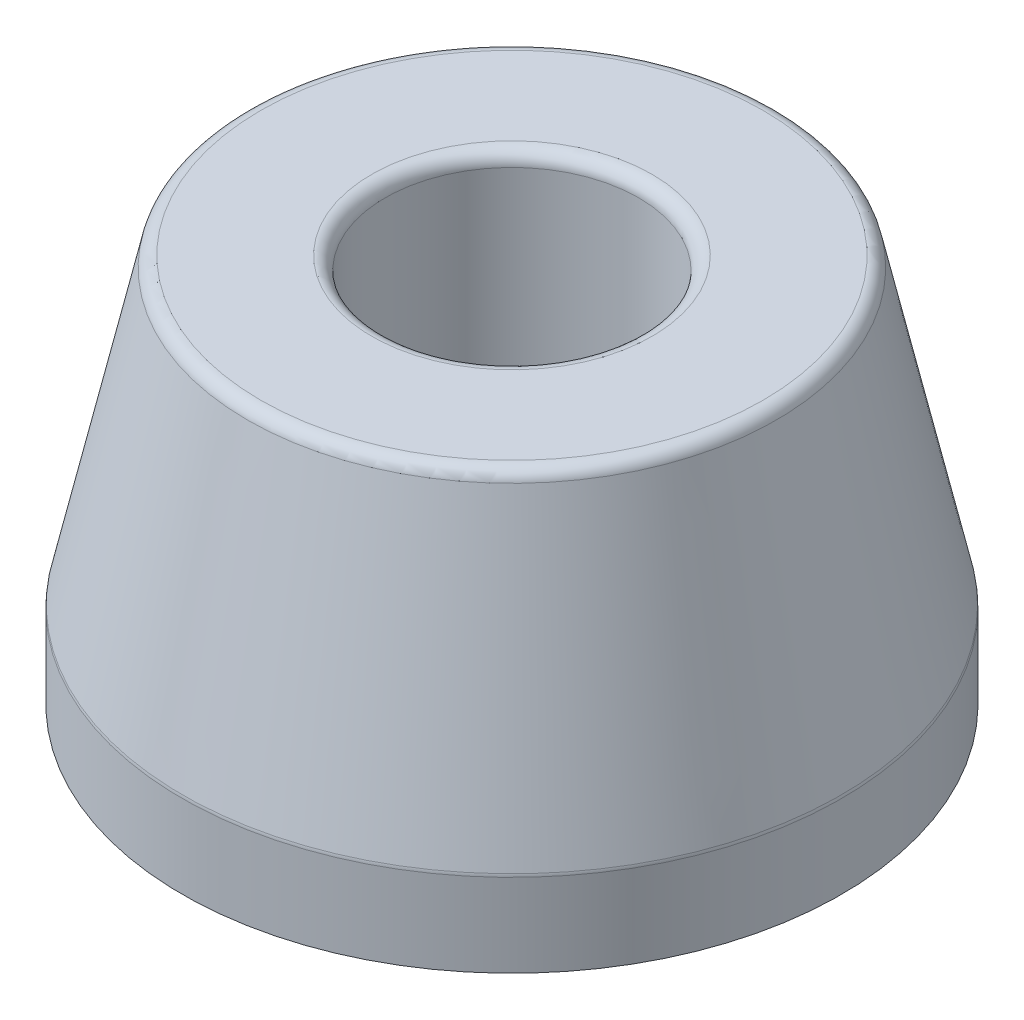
ISO-10303-21;
HEADER;
FILE_DESCRIPTION(('STEP AP214'),'2;1');
FILE_NAME('part.step','',(''),(''),'','','');
FILE_SCHEMA(('AUTOMOTIVE_DESIGN { 1 0 10303 214 1 1 1 1 }'));
ENDSEC;
DATA;
#1=APPLICATION_CONTEXT('core data for automotive mechanical design processes');
#2=APPLICATION_PROTOCOL_DEFINITION('international standard','automotive_design',2000,#1);
#3=PRODUCT_CONTEXT('',#1,'mechanical');
#4=PRODUCT('Part','Part','',(#3));
#5=PRODUCT_RELATED_PRODUCT_CATEGORY('part','',(#4));
#6=PRODUCT_DEFINITION_FORMATION('','',#4);
#7=PRODUCT_DEFINITION_CONTEXT('part definition',#1,'design');
#8=PRODUCT_DEFINITION('design','',#6,#7);
#9=PRODUCT_DEFINITION_SHAPE('','',#8);
#10=(LENGTH_UNIT() NAMED_UNIT(*) SI_UNIT(.MILLI.,.METRE.));
#11=(NAMED_UNIT(*) PLANE_ANGLE_UNIT() SI_UNIT($,.RADIAN.));
#12=(NAMED_UNIT(*) SI_UNIT($,.STERADIAN.) SOLID_ANGLE_UNIT());
#13=UNCERTAINTY_MEASURE_WITH_UNIT(LENGTH_MEASURE(1.E-05),#10,'distance_accuracy_value','');
#14=(GEOMETRIC_REPRESENTATION_CONTEXT(3) GLOBAL_UNCERTAINTY_ASSIGNED_CONTEXT((#13)) GLOBAL_UNIT_ASSIGNED_CONTEXT((#10,
#11,#12)) REPRESENTATION_CONTEXT('',''));
#15=CARTESIAN_POINT('',(0.,0.,0.));
#16=DIRECTION('',(0.,0.,1.));
#17=DIRECTION('',(1.,0.,0.));
#18=AXIS2_PLACEMENT_3D('',#15,#16,#17);
#19=CARTESIAN_POINT('',(12.3825,0.,0.));
#20=DIRECTION('',(0.,-1.,0.));
#21=DIRECTION('',(0.,0.,-1.));
#22=AXIS2_PLACEMENT_3D('',#19,#20,#21);
#23=PLANE('',#22);
#24=CARTESIAN_POINT('',(0.,0.,0.));
#25=DIRECTION('',(0.,-1.,0.));
#26=DIRECTION('',(0.,0.,-1.));
#27=AXIS2_PLACEMENT_3D('',#24,#25,#26);
#28=CIRCLE('',#27,12.3825);
#29=CARTESIAN_POINT('',(0.,0.,-12.3825));
#30=VERTEX_POINT('',#29);
#31=EDGE_CURVE('E60',#30,#30,#28,.T.);
#32=ORIENTED_EDGE('',*,*,#31,.T.);
#33=EDGE_LOOP('',(#32));
#34=FACE_BOUND('',#33,.T.);
#35=CARTESIAN_POINT('',(0.,0.,0.));
#36=DIRECTION('',(0.,-1.,0.));
#37=DIRECTION('',(0.,0.,-1.));
#38=AXIS2_PLACEMENT_3D('',#35,#36,#37);
#39=CIRCLE('',#38,4.7625);
#40=CARTESIAN_POINT('',(0.,0.,-4.7625));
#41=VERTEX_POINT('',#40);
#42=EDGE_CURVE('E10',#41,#41,#39,.T.);
#43=ORIENTED_EDGE('',*,*,#42,.F.);
#44=EDGE_LOOP('',(#43));
#45=FACE_BOUND('',#44,.T.);
#46=ADVANCED_FACE('F32',(#34,#45),#23,.T.);
#47=CARTESIAN_POINT('',(0.,0.,0.));
#48=DIRECTION('',(0.,-1.,0.));
#49=DIRECTION('',(0.,0.,-1.));
#50=AXIS2_PLACEMENT_3D('',#47,#48,#49);
#51=CYLINDRICAL_SURFACE('',#50,4.7625);
#52=ORIENTED_EDGE('',*,*,#42,.T.);
#53=EDGE_LOOP('',(#52));
#54=FACE_BOUND('',#53,.T.);
#55=CARTESIAN_POINT('',(0.,14.097,0.));
#56=DIRECTION('',(0.,-1.,0.));
#57=DIRECTION('',(0.,0.,-1.));
#58=AXIS2_PLACEMENT_3D('',#55,#56,#57);
#59=CIRCLE('',#58,4.7625);
#60=CARTESIAN_POINT('',(0.,14.097,-4.7625));
#61=VERTEX_POINT('',#60);
#62=EDGE_CURVE('E38',#61,#61,#59,.T.);
#63=ORIENTED_EDGE('',*,*,#62,.F.);
#64=EDGE_LOOP('',(#63));
#65=FACE_BOUND('',#64,.T.);
#66=ADVANCED_FACE('F78',(#54,#65),#51,.F.);
#67=CARTESIAN_POINT('',(0.,14.097,0.));
#68=DIRECTION('',(0.,-1.,0.));
#69=DIRECTION('',(0.,0.,-1.));
#70=AXIS2_PLACEMENT_3D('',#67,#68,#69);
#71=TOROIDAL_SURFACE('',#70,5.2705,0.508);
#72=ORIENTED_EDGE('',*,*,#62,.T.);
#73=EDGE_LOOP('',(#72));
#74=FACE_BOUND('',#73,.T.);
#75=CARTESIAN_POINT('',(0.,14.605,0.));
#76=DIRECTION('',(0.,-1.,0.));
#77=DIRECTION('',(0.,0.,-1.));
#78=AXIS2_PLACEMENT_3D('',#75,#76,#77);
#79=CIRCLE('',#78,5.2705);
#80=CARTESIAN_POINT('',(0.,14.605,-5.2705));
#81=VERTEX_POINT('',#80);
#82=EDGE_CURVE('E42',#81,#81,#79,.T.);
#83=ORIENTED_EDGE('',*,*,#82,.F.);
#84=EDGE_LOOP('',(#83));
#85=FACE_BOUND('',#84,.T.);
#86=ADVANCED_FACE('F82',(#74,#85),#71,.T.);
#87=CARTESIAN_POINT('',(5.2705,14.605,0.));
#88=DIRECTION('',(0.,1.,0.));
#89=DIRECTION('',(0.,0.,1.));
#90=AXIS2_PLACEMENT_3D('',#87,#88,#89);
#91=PLANE('',#90);
#92=ORIENTED_EDGE('',*,*,#82,.T.);
#93=EDGE_LOOP('',(#92));
#94=FACE_BOUND('',#93,.T.);
#95=CARTESIAN_POINT('',(0.,14.605,0.));
#96=DIRECTION('',(0.,-1.,0.));
#97=DIRECTION('',(0.,0.,-1.));
#98=AXIS2_PLACEMENT_3D('',#95,#96,#97);
#99=CIRCLE('',#98,9.43499682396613);
#100=CARTESIAN_POINT('',(0.,14.605,-9.43499682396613));
#101=VERTEX_POINT('',#100);
#102=EDGE_CURVE('E46',#101,#101,#99,.T.);
#103=ORIENTED_EDGE('',*,*,#102,.F.);
#104=EDGE_LOOP('',(#103));
#105=FACE_BOUND('',#104,.T.);
#106=ADVANCED_FACE('F86',(#94,#105),#91,.T.);
#107=CARTESIAN_POINT('',(0.,14.097,0.));
#108=DIRECTION('',(0.,-1.,0.));
#109=DIRECTION('',(0.,0.,-1.));
#110=AXIS2_PLACEMENT_3D('',#107,#108,#109);
#111=TOROIDAL_SURFACE('',#110,9.43499682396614,0.507999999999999);
#112=ORIENTED_EDGE('',*,*,#102,.T.);
#113=EDGE_LOOP('',(#112));
#114=FACE_BOUND('',#113,.T.);
#115=CARTESIAN_POINT('',(0.,14.2072006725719,0.));
#116=DIRECTION('',(0.,-1.,0.));
#117=DIRECTION('',(0.,0.,-1.));
#118=AXIS2_PLACEMENT_3D('',#115,#116,#117);
#119=CIRCLE('',#118,9.93089985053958);
#120=CARTESIAN_POINT('',(0.,14.2072006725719,-9.93089985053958));
#121=VERTEX_POINT('',#120);
#122=EDGE_CURVE('E51',#121,#121,#119,.T.);
#123=ORIENTED_EDGE('',*,*,#122,.F.);
#124=EDGE_LOOP('',(#123));
#125=FACE_BOUND('',#124,.T.);
#126=ADVANCED_FACE('F92',(#114,#125),#111,.T.);
#127=CARTESIAN_POINT('',(0.,3.22943638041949,0.));
#128=DIRECTION('',(0.,-1.,0.));
#129=DIRECTION('',(0.,0.,-1.));
#130=AXIS2_PLACEMENT_3D('',#127,#128,#129);
#131=CONICAL_SURFACE('',#130,12.3704030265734,0.218668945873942);
#132=ORIENTED_EDGE('',*,*,#122,.T.);
#133=EDGE_LOOP('',(#132));
#134=FACE_BOUND('',#133,.T.);
#135=CARTESIAN_POINT('',(0.,3.22943638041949,0.));
#136=DIRECTION('',(0.,-1.,0.));
#137=DIRECTION('',(0.,0.,-1.));
#138=AXIS2_PLACEMENT_3D('',#135,#136,#137);
#139=CIRCLE('',#138,12.3704030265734);
#140=CARTESIAN_POINT('',(0.,3.22943638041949,-12.3704030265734));
#141=VERTEX_POINT('',#140);
#142=EDGE_CURVE('E54',#141,#141,#139,.T.);
#143=ORIENTED_EDGE('',*,*,#142,.F.);
#144=EDGE_LOOP('',(#143));
#145=FACE_BOUND('',#144,.T.);
#146=ADVANCED_FACE('F74',(#134,#145),#131,.T.);
#147=CARTESIAN_POINT('',(0.,3.11923570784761,0.));
#148=DIRECTION('',(0.,-1.,0.));
#149=DIRECTION('',(0.,0.,-1.));
#150=AXIS2_PLACEMENT_3D('',#147,#148,#149);
#151=TOROIDAL_SURFACE('',#150,11.8745,0.508);
#152=ORIENTED_EDGE('',*,*,#142,.T.);
#153=EDGE_LOOP('',(#152));
#154=FACE_BOUND('',#153,.T.);
#155=CARTESIAN_POINT('',(0.,3.11923570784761,0.));
#156=DIRECTION('',(0.,-1.,0.));
#157=DIRECTION('',(0.,0.,-1.));
#158=AXIS2_PLACEMENT_3D('',#155,#156,#157);
#159=CIRCLE('',#158,12.3825);
#160=CARTESIAN_POINT('',(0.,3.11923570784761,-12.3825));
#161=VERTEX_POINT('',#160);
#162=EDGE_CURVE('E57',#161,#161,#159,.T.);
#163=ORIENTED_EDGE('',*,*,#162,.F.);
#164=EDGE_LOOP('',(#163));
#165=FACE_BOUND('',#164,.T.);
#166=ADVANCED_FACE('F68',(#154,#165),#151,.T.);
#167=CARTESIAN_POINT('',(0.,0.,0.));
#168=DIRECTION('',(0.,-1.,0.));
#169=DIRECTION('',(0.,0.,-1.));
#170=AXIS2_PLACEMENT_3D('',#167,#168,#169);
#171=CYLINDRICAL_SURFACE('',#170,12.3825);
#172=ORIENTED_EDGE('',*,*,#162,.T.);
#173=EDGE_LOOP('',(#172));
#174=FACE_BOUND('',#173,.T.);
#175=ORIENTED_EDGE('',*,*,#31,.F.);
#176=EDGE_LOOP('',(#175));
#177=FACE_BOUND('',#176,.T.);
#178=ADVANCED_FACE('F66',(#174,#177),#171,.T.);
#179=CLOSED_SHELL('',(#46,#66,#86,#106,#126,#146,#166,#178));
#180=MANIFOLD_SOLID_BREP('B2',#179);
#181=ADVANCED_BREP_SHAPE_REPRESENTATION('',(#18,#180),#14);
#182=SHAPE_DEFINITION_REPRESENTATION(#9,#181);
ENDSEC;
END-ISO-10303-21;
